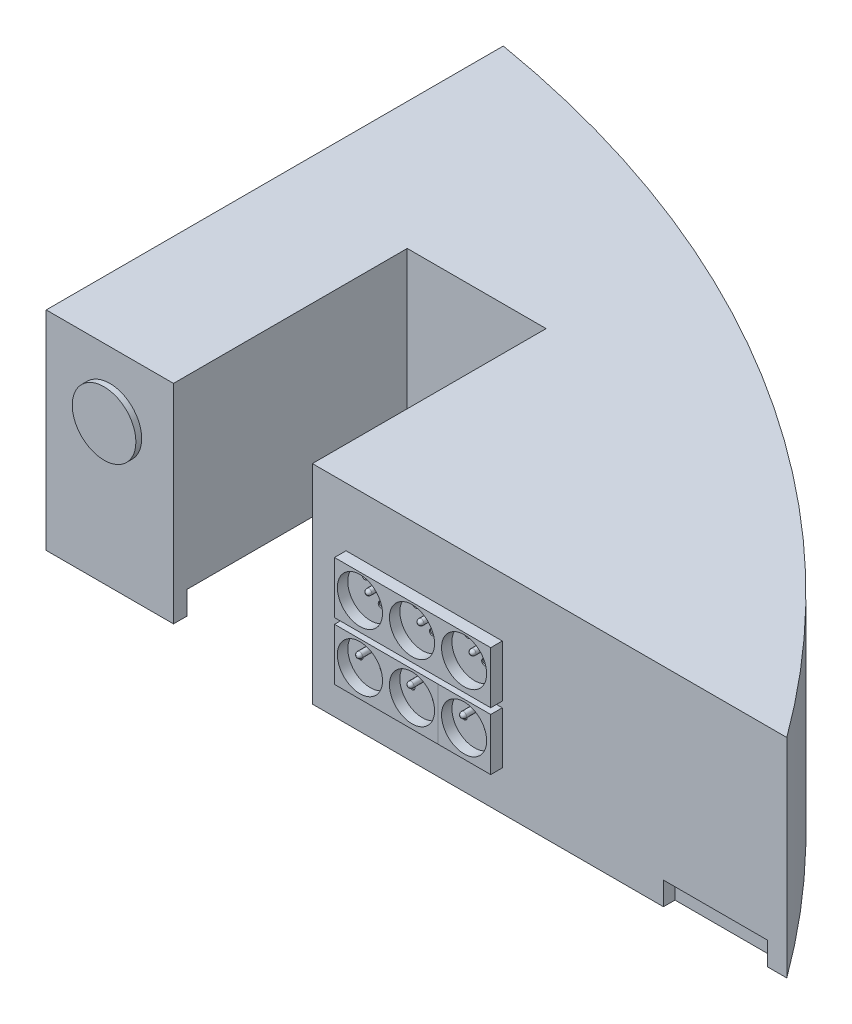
from build123d import *

# Parameters (mm, degrees)
ESQUISSE1_W                  = 640
ESQUISSE1_H                  = 180
EXTRUSION1_DEPTH             = 395
ESQUISSE2_W                  = 120
ESQUISSE2_H                  = 180
ENL_V_MAT_EXTRU_1_DEPTH      = 202
ENL_V_MAT_EXTRU_2_DEPTH      = 714.760296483
ENL_V_MAT_EXTRU_2_DEPTH_BACK = 714.760296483
ESQUISSE12_W                 = 135
ESQUISSE12_H                 = 45
EXTRUSION2_DEPTH             = 10
ESQUISSE13_R                 = 19.5
ENL_V_MAT_EXTRU_3_DEPTH      = 9
EXTRUSION6_START             = 0.0002
ESQUISSE14_W                 = 45.754008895
ESQUISSE14_H                 = 45
ESQUISSE14_R                 = 19.5
EXTRUSION6_DEPTH             = 0.0002
ESQUISSE15_R                 = 2.5
ENL_V_MAT_EXTRU_5_DEPTH      = 1
ESQUISSE16_R                 = 2.5
EXTRUSION7_DEPTH             = 12
CONG_1_R                     = 2.5
ESQUISSE17_R                 = 2.5
ENL_V_MAT_EXTRU_6_DEPTH      = 1
ESQUISSE18_R                 = 2.5
EXTRUSION8_DEPTH             = 12
CONG_2_R                     = 2.5
ESQUISSE19_R                 = 27.5
EXTRUSION9_DEPTH             = 5
ENL_V_MAT_EXTRU_9_DEPTH      = 20
ESQUISSE21_W                 = 90
ESQUISSE21_H                 = 20
ENL_V_MAT_EXTRU_8_DEPTH      = 10


with BuildPart() as part:
    # Esquisse1 → Extrusion1 (new body)
    with BuildSketch(Plane.XY):
        with Locations((246.594, 69.2736)):
            Rectangle(ESQUISSE1_W, ESQUISSE1_H)
    extrude(amount=EXTRUSION1_DEPTH)

    # Esquisse2 → Enl_v. mat.-Extru.1 (cut)
    with BuildSketch(Plane.XY.offset(395)):
        with Locations((96.594, 69.2736)):
            Rectangle(ESQUISSE2_W, ESQUISSE2_H)
    extrude(amount=-ENL_V_MAT_EXTRU_1_DEPTH, mode=Mode.SUBTRACT)

    # Esquisse3 → Enl_v. mat.-Extru.2 (cut, two sides: drawn at the far end of the back side and taken through both)
    with BuildSketch(Plane(origin=(0, 159.2736, 0), x_dir=(1, 0, 0), z_dir=(0, 1, 0)).offset(-ENL_V_MAT_EXTRU_2_DEPTH_BACK)):
        with BuildLine():
            Line((1461.48464085, -1616.41473662), (566.594, -395))
            ThreePointArc((566.594, -395), (285.142642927, -135.041439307), (-73.406, 0))
            Line((-73.406, 0), (-1566.390194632, 252.351763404))
            Line((-1566.390194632, 252.351763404), (24.114000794, 2829.371219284))
            Line((24.114000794, 2829.371219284), (3051.988836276, 960.60471926))
            Line((3051.988836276, 960.60471926), (1461.48464085, -1616.41473662))
        make_face()
    extrude(amount=ENL_V_MAT_EXTRU_2_DEPTH + ENL_V_MAT_EXTRU_2_DEPTH_BACK, mode=Mode.SUBTRACT)

    # Esquisse12 → Extrusion2 (add)
    with BuildSketch(Plane.XY.offset(395)):
        with Locations((253.217206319, 86.061294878)):
            Rectangle(ESQUISSE12_W, ESQUISSE12_H)
        with Locations((253.217206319, 36.061294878)):
            Rectangle(ESQUISSE12_W, ESQUISSE12_H)
    extrude(amount=EXTRUSION2_DEPTH)

    # Esquisse13 → Enl_v. mat.-Extru.3 (cut)
    with BuildSketch(Plane.XY.offset(405)):
        with Locations((297.717206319, 87.345939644)):
            Circle(ESQUISSE13_R)
        with Locations((252.717206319, 87.345939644)):
            Circle(ESQUISSE13_R)
        with Locations((207.717206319, 87.345939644)):
            Circle(ESQUISSE13_R)
        with Locations((207.717206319, 37.0576902)):
            Circle(ESQUISSE13_R)
        with Locations((252.717206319, 37.0576902)):
            Circle(ESQUISSE13_R)
        with Locations((297.717206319, 37.0576902)):
            Circle(ESQUISSE13_R)
    extrude(amount=-ENL_V_MAT_EXTRU_3_DEPTH, mode=Mode.SUBTRACT)

    # Esquisse14 → Extrusion6 (add)
    with BuildSketch(Plane.XY.offset(405).offset(EXTRUSION6_START)):
        with Locations((297.840201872, 36.061294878)):
            Rectangle(ESQUISSE14_W, ESQUISSE14_H)
        with Locations((297.717206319, 37.0576902)):
            Circle(ESQUISSE14_R, mode=Mode.SUBTRACT)
    extrude(amount=-EXTRUSION6_DEPTH)

    # Esquisse15 → Enl_v. mat.-Extru.5 (cut)
    with BuildSketch(Plane.XY.offset(396)):
        with Locations((198.717206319, 36.533825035)):
            Circle(ESQUISSE15_R)
        with Locations((218.717206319, 36.533825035)):
            Circle(ESQUISSE15_R)
        with Locations((243.717206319, 36.533825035)):
            Circle(ESQUISSE15_R)
        with Locations((263.717206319, 36.533825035)):
            Circle(ESQUISSE15_R)
        with Locations((288.717206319, 36.533825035)):
            Circle(ESQUISSE15_R)
        with Locations((308.717206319, 36.533825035)):
            Circle(ESQUISSE15_R)
    extrude(amount=-ENL_V_MAT_EXTRU_5_DEPTH, mode=Mode.SUBTRACT)

    # Esquisse16 → Extrusion7 (add)
    with BuildSketch(Plane.XY.offset(396)):
        with Locations((297.774114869, 47.047907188)):
            Circle(ESQUISSE16_R)
        with Locations((252.333937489, 47.047907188)):
            Circle(ESQUISSE16_R)
        with Locations((207.915865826, 47.047907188)):
            Circle(ESQUISSE16_R)
    extrude(amount=EXTRUSION7_DEPTH)

    # Cong_1
    cong_1_edges = [part.edges().sort_by_distance(p)[0] for p in [
        (295.274114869, 47.047907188, 408),
        (249.833937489, 47.047907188, 408),
        (205.415865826, 47.047907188, 408),
    ]]
    fillet(cong_1_edges, radius=CONG_1_R)

    # Esquisse17 → Enl_v. mat.-Extru.6 (cut)
    with BuildSketch(Plane.XY.offset(396)):
        with Locations((203.026104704, 98.541213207)):
            Circle(ESQUISSE17_R)
        with Locations((217.032579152, 84.264705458)):
            Circle(ESQUISSE17_R)
        with Locations((246.504457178, 99.214101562)):
            Circle(ESQUISSE17_R)
        with Locations((261.268654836, 85.722679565)):
            Circle(ESQUISSE17_R)
        with Locations((291.504457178, 99.214101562)):
            Circle(ESQUISSE17_R)
        with Locations((306.443393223, 85.922203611)):
            Circle(ESQUISSE17_R)
    extrude(amount=-ENL_V_MAT_EXTRU_6_DEPTH, mode=Mode.SUBTRACT)

    # Esquisse18 → Extrusion8 (add)
    with BuildSketch(Plane.XY.offset(396)):
        with Locations((305.988210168, 98.205218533)):
            Circle(ESQUISSE18_R)
        with Locations((260.988210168, 98.205218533)):
            Circle(ESQUISSE18_R)
        with Locations((215.988210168, 98.205218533)):
            Circle(ESQUISSE18_R)
    extrude(amount=EXTRUSION8_DEPTH)

    # Cong_2
    cong_2_edges = [part.edges().sort_by_distance(p)[0] for p in [
        (303.488210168, 98.205218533, 408),
        (258.488210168, 98.205218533, 408),
        (213.488210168, 98.205218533, 408),
    ]]
    fillet(cong_2_edges, radius=CONG_2_R)

    # Esquisse19 → Extrusion9 (add)
    with BuildSketch(Plane.XY.offset(395)):
        with Locations((-18.406, 104.2736)):
            Circle(ESQUISSE19_R)
    extrude(amount=EXTRUSION9_DEPTH)

    # Esquisse22 → Enl_v. mat.-Extru.9 (cut)
    with BuildSketch(Plane.XZ.offset(20.7264)):
        with BuildLine():
            Line((542.99729697, 383.501683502), (-63.187647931, 383.501683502))
            Line((-63.187647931, 383.501683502), (-63.187647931, 13.941748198))
            ThreePointArc((-63.187647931, 13.941748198), (274.244753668, 142.394321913), (542.99729697, 383.501683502))
        make_face()
    extrude(amount=-ENL_V_MAT_EXTRU_9_DEPTH, mode=Mode.SUBTRACT)

    # Esquisse21 → Enl_v. mat.-Extru.8 (cut)
    with BuildSketch(Plane.XY.offset(395)):
        with Locations((505, -10.7264)):
            Rectangle(ESQUISSE21_W, ESQUISSE21_H)
    extrude(amount=-ENL_V_MAT_EXTRU_8_DEPTH, mode=Mode.SUBTRACT)


solid = part.part
